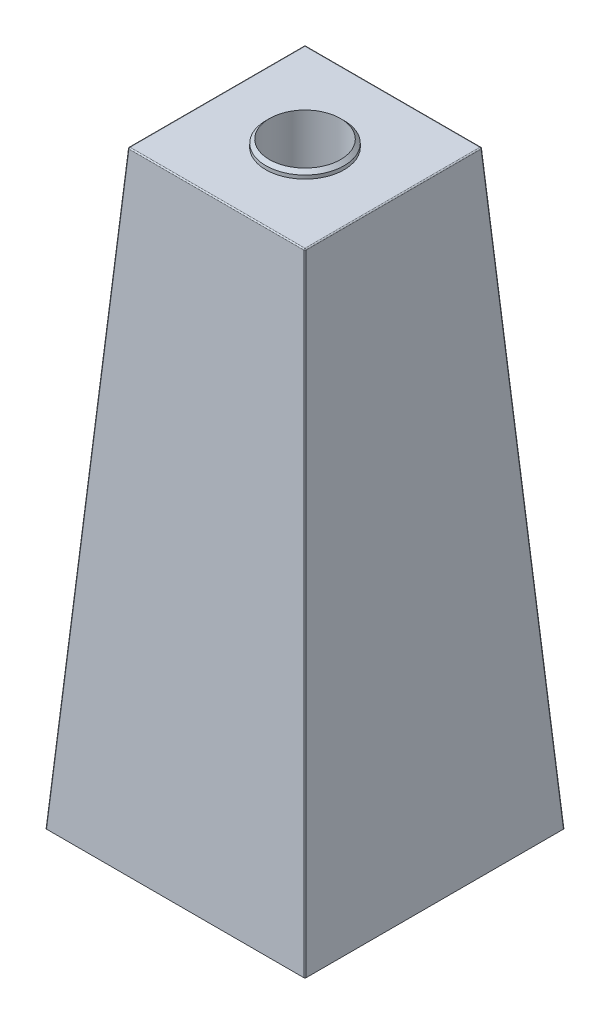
ISO-10303-21;
HEADER;
FILE_DESCRIPTION(('STEP AP214'),'2;1');
FILE_NAME('part.step','',(''),(''),'','','');
FILE_SCHEMA(('AUTOMOTIVE_DESIGN { 1 0 10303 214 1 1 1 1 }'));
ENDSEC;
DATA;
#1=APPLICATION_CONTEXT('core data for automotive mechanical design processes');
#2=APPLICATION_PROTOCOL_DEFINITION('international standard','automotive_design',2000,#1);
#3=PRODUCT_CONTEXT('',#1,'mechanical');
#4=PRODUCT('Part','Part','',(#3));
#5=PRODUCT_RELATED_PRODUCT_CATEGORY('part','',(#4));
#6=PRODUCT_DEFINITION_FORMATION('','',#4);
#7=PRODUCT_DEFINITION_CONTEXT('part definition',#1,'design');
#8=PRODUCT_DEFINITION('design','',#6,#7);
#9=PRODUCT_DEFINITION_SHAPE('','',#8);
#10=(LENGTH_UNIT() NAMED_UNIT(*) SI_UNIT(.MILLI.,.METRE.));
#11=(NAMED_UNIT(*) PLANE_ANGLE_UNIT() SI_UNIT($,.RADIAN.));
#12=(NAMED_UNIT(*) SI_UNIT($,.STERADIAN.) SOLID_ANGLE_UNIT());
#13=UNCERTAINTY_MEASURE_WITH_UNIT(LENGTH_MEASURE(1.E-05),#10,'distance_accuracy_value','');
#14=(GEOMETRIC_REPRESENTATION_CONTEXT(3) GLOBAL_UNCERTAINTY_ASSIGNED_CONTEXT((#13)) GLOBAL_UNIT_ASSIGNED_CONTEXT((#10,
#11,#12)) REPRESENTATION_CONTEXT('',''));
#15=CARTESIAN_POINT('',(0.,0.,0.));
#16=DIRECTION('',(0.,0.,1.));
#17=DIRECTION('',(1.,0.,0.));
#18=AXIS2_PLACEMENT_3D('',#15,#16,#17);
#19=CARTESIAN_POINT('',(0.,-343.762359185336,0.));
#20=DIRECTION('',(0.,1.,0.));
#21=DIRECTION('',(0.,0.,1.));
#22=AXIS2_PLACEMENT_3D('',#19,#20,#21);
#23=CYLINDRICAL_SURFACE('',#22,33.15);
#24=CARTESIAN_POINT('',(0.,3.,0.));
#25=DIRECTION('',(0.,1.,0.));
#26=DIRECTION('',(0.,0.,1.));
#27=AXIS2_PLACEMENT_3D('',#24,#25,#26);
#28=CIRCLE('',#27,33.15);
#29=CARTESIAN_POINT('',(0.,3.,33.15));
#30=VERTEX_POINT('',#29);
#31=EDGE_CURVE('E11',#30,#30,#28,.F.);
#32=ORIENTED_EDGE('',*,*,#31,.T.);
#33=EDGE_LOOP('',(#32));
#34=FACE_BOUND('',#33,.T.);
#35=CARTESIAN_POINT('',(0.,-250.,0.));
#36=DIRECTION('',(0.,1.,0.));
#37=DIRECTION('',(0.,0.,1.));
#38=AXIS2_PLACEMENT_3D('',#35,#36,#37);
#39=CIRCLE('',#38,33.15);
#40=CARTESIAN_POINT('',(0.,-250.,33.15));
#41=VERTEX_POINT('',#40);
#42=EDGE_CURVE('E40',#41,#41,#39,.F.);
#43=ORIENTED_EDGE('',*,*,#42,.F.);
#44=EDGE_LOOP('',(#43));
#45=FACE_BOUND('',#44,.T.);
#46=ADVANCED_FACE('F34',(#34,#45),#23,.T.);
#47=CARTESIAN_POINT('',(0.,-343.762359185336,0.));
#48=DIRECTION('',(0.,1.,0.));
#49=DIRECTION('',(0.,0.,1.));
#50=AXIS2_PLACEMENT_3D('',#47,#48,#49);
#51=CYLINDRICAL_SURFACE('',#50,30.15);
#52=CARTESIAN_POINT('',(0.,-250.,0.));
#53=DIRECTION('',(0.,1.,0.));
#54=DIRECTION('',(0.,0.,1.));
#55=AXIS2_PLACEMENT_3D('',#52,#53,#54);
#56=CIRCLE('',#55,30.15);
#57=CARTESIAN_POINT('',(0.,-250.,30.15));
#58=VERTEX_POINT('',#57);
#59=EDGE_CURVE('E44',#58,#58,#56,.F.);
#60=ORIENTED_EDGE('',*,*,#59,.T.);
#61=EDGE_LOOP('',(#60));
#62=FACE_BOUND('',#61,.T.);
#63=CARTESIAN_POINT('',(0.,6.,0.));
#64=DIRECTION('',(0.,1.,0.));
#65=DIRECTION('',(0.,0.,1.));
#66=AXIS2_PLACEMENT_3D('',#63,#64,#65);
#67=CIRCLE('',#66,30.15);
#68=CARTESIAN_POINT('',(0.,6.,30.15));
#69=VERTEX_POINT('',#68);
#70=EDGE_CURVE('E49',#69,#69,#67,.T.);
#71=ORIENTED_EDGE('',*,*,#70,.T.);
#72=EDGE_LOOP('',(#71));
#73=FACE_BOUND('',#72,.T.);
#74=ADVANCED_FACE('F54',(#62,#73),#51,.F.);
#75=CARTESIAN_POINT('',(0.,-250.,0.));
#76=DIRECTION('',(0.,1.,0.));
#77=DIRECTION('',(0.,0.,1.));
#78=AXIS2_PLACEMENT_3D('',#75,#76,#77);
#79=PLANE('',#78);
#80=ORIENTED_EDGE('',*,*,#42,.T.);
#81=EDGE_LOOP('',(#80));
#82=FACE_BOUND('',#81,.T.);
#83=ORIENTED_EDGE('',*,*,#59,.F.);
#84=EDGE_LOOP('',(#83));
#85=FACE_BOUND('',#84,.T.);
#86=ADVANCED_FACE('F58',(#82,#85),#79,.F.);
#87=CARTESIAN_POINT('',(0.,6.00000000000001,0.));
#88=DIRECTION('',(0.,-1.,0.));
#89=DIRECTION('',(0.,0.,-1.));
#90=AXIS2_PLACEMENT_3D('',#87,#88,#89);
#91=CONICAL_SURFACE('',#90,30.15,0.785398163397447);
#92=ORIENTED_EDGE('',*,*,#31,.F.);
#93=EDGE_LOOP('',(#92));
#94=FACE_BOUND('',#93,.T.);
#95=ORIENTED_EDGE('',*,*,#70,.F.);
#96=EDGE_LOOP('',(#95));
#97=FACE_BOUND('',#96,.T.);
#98=ADVANCED_FACE('F56',(#94,#97),#91,.T.);
#99=CLOSED_SHELL('',(#46,#74,#86,#98));
#100=MANIFOLD_SOLID_BREP('B2',#99);
#101=CARTESIAN_POINT('',(75.,0.,75.));
#102=DIRECTION('',(0.997564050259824,0.0697564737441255,0.));
#103=DIRECTION('',(-0.0697564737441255,0.997564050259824,0.));
#104=AXIS2_PLACEMENT_3D('',#101,#102,#103);
#105=PLANE('',#104);
#106=DIRECTION('',(0.,0.,1.));
#107=VECTOR('',#106,1.);
#108=CARTESIAN_POINT('',(75.0650489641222,-0.930243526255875,75.));
#109=LINE('',#108,#107);
#110=CARTESIAN_POINT('',(75.0650489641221,-0.930243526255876,-74.0674849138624));
#111=VERTEX_POINT('',#110);
#112=CARTESIAN_POINT('',(75.0650489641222,-0.930243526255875,74.0674849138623));
#113=VERTEX_POINT('',#112);
#114=EDGE_CURVE('E201',#111,#113,#109,.T.);
#115=ORIENTED_EDGE('',*,*,#114,.T.);
#116=DIRECTION('',(0.0695873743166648,-0.995145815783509,0.0695873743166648));
#117=VECTOR('',#116,1.);
#118=CARTESIAN_POINT('',(75.0048306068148,-0.069080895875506,74.0072665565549));
#119=LINE('',#118,#117);
#120=CARTESIAN_POINT('',(109.963405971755,-500.,108.965841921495));
#121=VERTEX_POINT('',#120);
#122=EDGE_CURVE('E203',#113,#121,#119,.T.);
#123=ORIENTED_EDGE('',*,*,#122,.T.);
#124=DIRECTION('',(0.,0.,-1.));
#125=VECTOR('',#124,1.);
#126=CARTESIAN_POINT('',(109.963405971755,-500.,-75.));
#127=LINE('',#126,#125);
#128=CARTESIAN_POINT('',(109.963405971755,-500.,-108.965841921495));
#129=VERTEX_POINT('',#128);
#130=EDGE_CURVE('E169',#129,#121,#127,.F.);
#131=ORIENTED_EDGE('',*,*,#130,.F.);
#132=DIRECTION('',(0.0695873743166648,-0.995145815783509,-0.0695873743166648));
#133=VECTOR('',#132,1.);
#134=CARTESIAN_POINT('',(74.2784702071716,10.318356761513,-73.2809061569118));
#135=LINE('',#134,#133);
#136=EDGE_CURVE('E199',#129,#111,#135,.F.);
#137=ORIENTED_EDGE('',*,*,#136,.T.);
#138=EDGE_LOOP('',(#115,#123,#131,#137));
#139=FACE_BOUND('',#138,.T.);
#140=ADVANCED_FACE('F88',(#139),#105,.T.);
#141=CARTESIAN_POINT('',(75.,0.,75.));
#142=DIRECTION('',(0.,0.0697564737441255,0.997564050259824));
#143=DIRECTION('',(0.,-0.997564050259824,0.0697564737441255));
#144=AXIS2_PLACEMENT_3D('',#141,#142,#143);
#145=PLANE('',#144);
#146=DIRECTION('',(1.,0.,0.));
#147=VECTOR('',#146,1.);
#148=CARTESIAN_POINT('',(75.0000000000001,-500.,109.963405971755));
#149=LINE('',#148,#147);
#150=CARTESIAN_POINT('',(108.965841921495,-500.,109.963405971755));
#151=VERTEX_POINT('',#150);
#152=CARTESIAN_POINT('',(-108.965841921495,-500.,109.963405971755));
#153=VERTEX_POINT('',#152);
#154=EDGE_CURVE('E166',#151,#153,#149,.F.);
#155=ORIENTED_EDGE('',*,*,#154,.F.);
#156=DIRECTION('',(0.0695873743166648,-0.995145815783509,0.0695873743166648));
#157=VECTOR('',#156,1.);
#158=CARTESIAN_POINT('',(74.0072665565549,-0.0690808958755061,75.0048306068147));
#159=LINE('',#158,#157);
#160=CARTESIAN_POINT('',(74.0674849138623,-0.930243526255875,75.0650489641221));
#161=VERTEX_POINT('',#160);
#162=EDGE_CURVE('E175',#151,#161,#159,.F.);
#163=ORIENTED_EDGE('',*,*,#162,.T.);
#164=DIRECTION('',(-1.,0.,0.));
#165=VECTOR('',#164,1.);
#166=CARTESIAN_POINT('',(-75.,-0.930243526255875,75.0650489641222));
#167=LINE('',#166,#165);
#168=CARTESIAN_POINT('',(-74.0674849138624,-0.930243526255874,75.0650489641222));
#169=VERTEX_POINT('',#168);
#170=EDGE_CURVE('E186',#161,#169,#167,.T.);
#171=ORIENTED_EDGE('',*,*,#170,.T.);
#172=DIRECTION('',(-0.0695873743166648,-0.995145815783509,0.0695873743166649));
#173=VECTOR('',#172,1.);
#174=CARTESIAN_POINT('',(-73.2809061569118,10.318356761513,74.2784702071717));
#175=LINE('',#174,#173);
#176=EDGE_CURVE('E178',#169,#153,#175,.T.);
#177=ORIENTED_EDGE('',*,*,#176,.T.);
#178=EDGE_LOOP('',(#155,#163,#171,#177));
#179=FACE_BOUND('',#178,.T.);
#180=ADVANCED_FACE('F90',(#179),#145,.T.);
#181=CARTESIAN_POINT('',(-75.,0.,75.0000000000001));
#182=DIRECTION('',(-0.997564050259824,0.0697564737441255,0.));
#183=DIRECTION('',(-0.0697564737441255,-0.997564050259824,0.));
#184=AXIS2_PLACEMENT_3D('',#181,#182,#183);
#185=PLANE('',#184);
#186=DIRECTION('',(0.,0.,-1.));
#187=VECTOR('',#186,1.);
#188=CARTESIAN_POINT('',(-75.0650489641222,-0.930243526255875,-75.));
#189=LINE('',#188,#187);
#190=CARTESIAN_POINT('',(-75.0650489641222,-0.930243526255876,74.0674849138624));
#191=VERTEX_POINT('',#190);
#192=CARTESIAN_POINT('',(-75.0650489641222,-0.930243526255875,-74.0674849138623));
#193=VERTEX_POINT('',#192);
#194=EDGE_CURVE('E103',#191,#193,#189,.T.);
#195=ORIENTED_EDGE('',*,*,#194,.T.);
#196=DIRECTION('',(-0.0695873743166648,-0.995145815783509,-0.0695873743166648));
#197=VECTOR('',#196,1.);
#198=CARTESIAN_POINT('',(-74.2784702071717,10.318356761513,-73.2809061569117));
#199=LINE('',#198,#197);
#200=CARTESIAN_POINT('',(-109.963405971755,-500.,-108.965841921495));
#201=VERTEX_POINT('',#200);
#202=EDGE_CURVE('E213',#193,#201,#199,.T.);
#203=ORIENTED_EDGE('',*,*,#202,.T.);
#204=DIRECTION('',(0.,0.,1.));
#205=VECTOR('',#204,1.);
#206=CARTESIAN_POINT('',(-109.963405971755,-500.,-75.));
#207=LINE('',#206,#205);
#208=CARTESIAN_POINT('',(-109.963405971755,-500.,108.965841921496));
#209=VERTEX_POINT('',#208);
#210=EDGE_CURVE('E179',#209,#201,#207,.F.);
#211=ORIENTED_EDGE('',*,*,#210,.F.);
#212=DIRECTION('',(-0.0695873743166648,-0.995145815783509,0.0695873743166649));
#213=VECTOR('',#212,1.);
#214=CARTESIAN_POINT('',(-75.0048306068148,-0.0690808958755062,74.007266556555));
#215=LINE('',#214,#213);
#216=EDGE_CURVE('E108',#209,#191,#215,.F.);
#217=ORIENTED_EDGE('',*,*,#216,.T.);
#218=EDGE_LOOP('',(#195,#203,#211,#217));
#219=FACE_BOUND('',#218,.T.);
#220=ADVANCED_FACE('F325',(#219),#185,.T.);
#221=CARTESIAN_POINT('',(75.,0.,-75.));
#222=DIRECTION('',(0.,0.0697564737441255,-0.997564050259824));
#223=DIRECTION('',(0.,0.997564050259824,0.0697564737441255));
#224=AXIS2_PLACEMENT_3D('',#221,#222,#223);
#225=PLANE('',#224);
#226=DIRECTION('',(1.,0.,0.));
#227=VECTOR('',#226,1.);
#228=CARTESIAN_POINT('',(75.,-0.930243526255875,-75.0650489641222));
#229=LINE('',#228,#227);
#230=CARTESIAN_POINT('',(-74.0674849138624,-0.930243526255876,-75.0650489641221));
#231=VERTEX_POINT('',#230);
#232=CARTESIAN_POINT('',(74.0674849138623,-0.930243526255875,-75.0650489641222));
#233=VERTEX_POINT('',#232);
#234=EDGE_CURVE('E207',#231,#233,#229,.T.);
#235=ORIENTED_EDGE('',*,*,#234,.T.);
#236=DIRECTION('',(0.0695873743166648,-0.995145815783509,-0.0695873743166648));
#237=VECTOR('',#236,1.);
#238=CARTESIAN_POINT('',(74.0072665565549,-0.0690808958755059,-75.0048306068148));
#239=LINE('',#238,#237);
#240=CARTESIAN_POINT('',(108.965841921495,-500.,-109.963405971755));
#241=VERTEX_POINT('',#240);
#242=EDGE_CURVE('E209',#233,#241,#239,.T.);
#243=ORIENTED_EDGE('',*,*,#242,.T.);
#244=DIRECTION('',(-1.,0.,0.));
#245=VECTOR('',#244,1.);
#246=CARTESIAN_POINT('',(75.,-500.,-109.963405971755));
#247=LINE('',#246,#245);
#248=CARTESIAN_POINT('',(-108.965841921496,-500.,-109.963405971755));
#249=VERTEX_POINT('',#248);
#250=EDGE_CURVE('E221',#249,#241,#247,.F.);
#251=ORIENTED_EDGE('',*,*,#250,.F.);
#252=DIRECTION('',(-0.0695873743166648,-0.995145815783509,-0.0695873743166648));
#253=VECTOR('',#252,1.);
#254=CARTESIAN_POINT('',(-73.2809061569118,10.318356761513,-74.2784702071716));
#255=LINE('',#254,#253);
#256=EDGE_CURVE('E205',#249,#231,#255,.F.);
#257=ORIENTED_EDGE('',*,*,#256,.T.);
#258=EDGE_LOOP('',(#235,#243,#251,#257));
#259=FACE_BOUND('',#258,.T.);
#260=ADVANCED_FACE('F285',(#259),#225,.T.);
#261=CARTESIAN_POINT('',(75.,-500.,-75.));
#262=DIRECTION('',(0.,1.,0.));
#263=DIRECTION('',(0.,0.,1.));
#264=AXIS2_PLACEMENT_3D('',#261,#262,#263);
#265=PLANE('',#264);
#266=ORIENTED_EDGE('',*,*,#130,.T.);
#267=CARTESIAN_POINT('',(108.960964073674,-500.,108.960964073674));
#268=DIRECTION('',(0.,1.,0.));
#269=DIRECTION('',(-0.707106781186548,0.,-0.707106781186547));
#270=AXIS2_PLACEMENT_3D('',#267,#268,#269);
#271=ELLIPSE('',#270,1.00487786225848,1.);
#272=EDGE_CURVE('E32',#121,#151,#271,.F.);
#273=ORIENTED_EDGE('',*,*,#272,.T.);
#274=ORIENTED_EDGE('',*,*,#154,.T.);
#275=CARTESIAN_POINT('',(-108.960964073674,-500.,108.960964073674));
#276=DIRECTION('',(0.,1.,0.));
#277=DIRECTION('',(0.707106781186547,0.,-0.707106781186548));
#278=AXIS2_PLACEMENT_3D('',#275,#276,#277);
#279=ELLIPSE('',#278,1.00487786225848,1.);
#280=EDGE_CURVE('E215',#153,#209,#279,.F.);
#281=ORIENTED_EDGE('',*,*,#280,.T.);
#282=ORIENTED_EDGE('',*,*,#210,.T.);
#283=CARTESIAN_POINT('',(-108.960964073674,-500.,-108.960964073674));
#284=DIRECTION('',(0.,1.,0.));
#285=DIRECTION('',(0.707106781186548,0.,0.707106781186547));
#286=AXIS2_PLACEMENT_3D('',#283,#284,#285);
#287=ELLIPSE('',#286,1.00487786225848,1.);
#288=EDGE_CURVE('E217',#201,#249,#287,.F.);
#289=ORIENTED_EDGE('',*,*,#288,.T.);
#290=ORIENTED_EDGE('',*,*,#250,.T.);
#291=CARTESIAN_POINT('',(108.960964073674,-500.,-108.960964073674));
#292=DIRECTION('',(0.,1.,0.));
#293=DIRECTION('',(-0.707106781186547,0.,0.707106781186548));
#294=AXIS2_PLACEMENT_3D('',#291,#292,#293);
#295=ELLIPSE('',#294,1.00487786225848,1.);
#296=EDGE_CURVE('E96',#241,#129,#295,.F.);
#297=ORIENTED_EDGE('',*,*,#296,.T.);
#298=EDGE_LOOP('',(#266,#273,#274,#281,#282,#289,#290,#297));
#299=FACE_BOUND('',#298,.T.);
#300=ADVANCED_FACE('F165',(#299),#265,.F.);
#301=CARTESIAN_POINT('',(75.,0.,-75.));
#302=DIRECTION('',(0.,1.,0.));
#303=DIRECTION('',(0.,0.,1.));
#304=AXIS2_PLACEMENT_3D('',#301,#302,#303);
#305=PLANE('',#304);
#306=DIRECTION('',(0.,0.,1.));
#307=VECTOR('',#306,1.);
#308=CARTESIAN_POINT('',(-74.0674849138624,0.,75.0000000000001));
#309=LINE('',#308,#307);
#310=CARTESIAN_POINT('',(-74.0674849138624,0.,-74.0674849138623));
#311=VERTEX_POINT('',#310);
#312=CARTESIAN_POINT('',(-74.0674849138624,0.,74.0674849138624));
#313=VERTEX_POINT('',#312);
#314=EDGE_CURVE('E185',#311,#313,#309,.T.);
#315=ORIENTED_EDGE('',*,*,#314,.T.);
#316=DIRECTION('',(1.,0.,0.));
#317=VECTOR('',#316,1.);
#318=CARTESIAN_POINT('',(75.,0.,74.0674849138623));
#319=LINE('',#318,#317);
#320=CARTESIAN_POINT('',(74.0674849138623,0.,74.0674849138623));
#321=VERTEX_POINT('',#320);
#322=EDGE_CURVE('E196',#313,#321,#319,.T.);
#323=ORIENTED_EDGE('',*,*,#322,.T.);
#324=DIRECTION('',(0.,0.,-1.));
#325=VECTOR('',#324,1.);
#326=CARTESIAN_POINT('',(74.0674849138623,0.,-75.));
#327=LINE('',#326,#325);
#328=CARTESIAN_POINT('',(74.0674849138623,0.,-74.0674849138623));
#329=VERTEX_POINT('',#328);
#330=EDGE_CURVE('E194',#321,#329,#327,.T.);
#331=ORIENTED_EDGE('',*,*,#330,.T.);
#332=DIRECTION('',(-1.,0.,0.));
#333=VECTOR('',#332,1.);
#334=CARTESIAN_POINT('',(-75.0000000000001,0.,-74.0674849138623));
#335=LINE('',#334,#333);
#336=EDGE_CURVE('E188',#329,#311,#335,.T.);
#337=ORIENTED_EDGE('',*,*,#336,.T.);
#338=EDGE_LOOP('',(#315,#323,#331,#337));
#339=FACE_BOUND('',#338,.T.);
#340=CARTESIAN_POINT('',(0.,0.,0.));
#341=DIRECTION('',(0.,1.,0.));
#342=DIRECTION('',(0.,0.,1.));
#343=AXIS2_PLACEMENT_3D('',#340,#341,#342);
#344=CIRCLE('',#343,33.15);
#345=CARTESIAN_POINT('',(0.,0.,33.15));
#346=VERTEX_POINT('',#345);
#347=EDGE_CURVE('E271',#346,#346,#344,.T.);
#348=ORIENTED_EDGE('',*,*,#347,.F.);
#349=EDGE_LOOP('',(#348));
#350=FACE_BOUND('',#349,.T.);
#351=ADVANCED_FACE('F292',(#339,#350),#305,.T.);
#352=CARTESIAN_POINT('',(0.,-250.,0.));
#353=DIRECTION('',(0.,1.,0.));
#354=DIRECTION('',(0.,0.,1.));
#355=AXIS2_PLACEMENT_3D('',#352,#353,#354);
#356=CYLINDRICAL_SURFACE('',#355,33.15);
#357=CARTESIAN_POINT('',(0.,-250.,0.));
#358=DIRECTION('',(0.,1.,0.));
#359=DIRECTION('',(0.,0.,1.));
#360=AXIS2_PLACEMENT_3D('',#357,#358,#359);
#361=CIRCLE('',#360,33.15);
#362=CARTESIAN_POINT('',(0.,-250.,33.15));
#363=VERTEX_POINT('',#362);
#364=EDGE_CURVE('E227',#363,#363,#361,.T.);
#365=ORIENTED_EDGE('',*,*,#364,.F.);
#366=EDGE_LOOP('',(#365));
#367=FACE_BOUND('',#366,.T.);
#368=ORIENTED_EDGE('',*,*,#347,.T.);
#369=EDGE_LOOP('',(#368));
#370=FACE_BOUND('',#369,.T.);
#371=ADVANCED_FACE('F350',(#367,#370),#356,.F.);
#372=CARTESIAN_POINT('',(0.,-250.,0.));
#373=DIRECTION('',(0.,1.,0.));
#374=DIRECTION('',(0.,0.,1.));
#375=AXIS2_PLACEMENT_3D('',#372,#373,#374);
#376=PLANE('',#375);
#377=ORIENTED_EDGE('',*,*,#364,.T.);
#378=EDGE_LOOP('',(#377));
#379=FACE_BOUND('',#378,.T.);
#380=ADVANCED_FACE('F357',(#379),#376,.T.);
#381=CARTESIAN_POINT('',(73.2809061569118,10.2486002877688,-73.2809061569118));
#382=DIRECTION('',(-0.0695873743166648,0.995145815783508,0.0695873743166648));
#383=DIRECTION('',(0.,-0.0697564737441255,0.997564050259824));
#384=AXIS2_PLACEMENT_3D('',#381,#382,#383);
#385=CYLINDRICAL_SURFACE('',#384,1.);
#386=ORIENTED_EDGE('',*,*,#296,.F.);
#387=ORIENTED_EDGE('',*,*,#242,.F.);
#388=CARTESIAN_POINT('',(74.0674849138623,-1.,-74.0674849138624));
#389=DIRECTION('',(-0.0695873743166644,0.995145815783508,0.0695873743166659));
#390=DIRECTION('',(0.,-0.0697564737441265,0.997564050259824));
#391=AXIS2_PLACEMENT_3D('',#388,#389,#390);
#392=CIRCLE('',#391,1.);
#393=EDGE_CURVE('E231',#111,#233,#392,.T.);
#394=ORIENTED_EDGE('',*,*,#393,.F.);
#395=ORIENTED_EDGE('',*,*,#136,.F.);
#396=EDGE_LOOP('',(#386,#387,#394,#395));
#397=FACE_BOUND('',#396,.T.);
#398=ADVANCED_FACE('F229',(#397),#385,.T.);
#399=CARTESIAN_POINT('',(-73.2809061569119,10.2486002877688,-73.2809061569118));
#400=DIRECTION('',(0.0695873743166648,0.995145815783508,0.0695873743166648));
#401=DIRECTION('',(-0.997564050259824,0.0697564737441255,0.));
#402=AXIS2_PLACEMENT_3D('',#399,#400,#401);
#403=CYLINDRICAL_SURFACE('',#402,1.);
#404=ORIENTED_EDGE('',*,*,#288,.F.);
#405=ORIENTED_EDGE('',*,*,#202,.F.);
#406=CARTESIAN_POINT('',(-74.0674849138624,-1.,-74.0674849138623));
#407=DIRECTION('',(0.0695873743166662,0.995145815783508,0.0695873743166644));
#408=DIRECTION('',(-0.997564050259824,0.0697564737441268,0.));
#409=AXIS2_PLACEMENT_3D('',#406,#407,#408);
#410=CIRCLE('',#409,1.);
#411=EDGE_CURVE('E237',#231,#193,#410,.T.);
#412=ORIENTED_EDGE('',*,*,#411,.F.);
#413=ORIENTED_EDGE('',*,*,#256,.F.);
#414=EDGE_LOOP('',(#404,#405,#412,#413));
#415=FACE_BOUND('',#414,.T.);
#416=ADVANCED_FACE('F281',(#415),#403,.T.);
#417=CARTESIAN_POINT('',(75.,-1.,-74.0674849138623));
#418=DIRECTION('',(1.,0.,0.));
#419=DIRECTION('',(0.,0.,-1.));
#420=AXIS2_PLACEMENT_3D('',#417,#418,#419);
#421=CYLINDRICAL_SURFACE('',#420,1.);
#422=CARTESIAN_POINT('',(74.0674849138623,-1.,-74.0674849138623));
#423=DIRECTION('',(1.,0.,0.));
#424=DIRECTION('',(0.,0.,-1.));
#425=AXIS2_PLACEMENT_3D('',#422,#423,#424);
#426=CIRCLE('',#425,1.);
#427=EDGE_CURVE('E236',#233,#329,#426,.T.);
#428=ORIENTED_EDGE('',*,*,#427,.F.);
#429=ORIENTED_EDGE('',*,*,#234,.F.);
#430=CARTESIAN_POINT('',(-74.0674849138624,-1.,-74.0674849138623));
#431=DIRECTION('',(-1.,0.,0.));
#432=DIRECTION('',(0.,0.,1.));
#433=AXIS2_PLACEMENT_3D('',#430,#431,#432);
#434=CIRCLE('',#433,1.);
#435=EDGE_CURVE('E245',#311,#231,#434,.T.);
#436=ORIENTED_EDGE('',*,*,#435,.F.);
#437=ORIENTED_EDGE('',*,*,#336,.F.);
#438=EDGE_LOOP('',(#428,#429,#436,#437));
#439=FACE_BOUND('',#438,.T.);
#440=ADVANCED_FACE('F288',(#439),#421,.T.);
#441=CARTESIAN_POINT('',(74.0674849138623,-1.,-74.0674849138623));
#442=DIRECTION('',(0.,0.,1.));
#443=DIRECTION('',(1.,0.,0.));
#444=AXIS2_PLACEMENT_3D('',#441,#442,#443);
#445=SPHERICAL_SURFACE('',#444,1.);
#446=ORIENTED_EDGE('',*,*,#393,.T.);
#447=ORIENTED_EDGE('',*,*,#427,.T.);
#448=CARTESIAN_POINT('',(74.0674849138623,-1.,-74.0674849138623));
#449=DIRECTION('',(0.,0.,-1.));
#450=DIRECTION('',(-1.,0.,0.));
#451=AXIS2_PLACEMENT_3D('',#448,#449,#450);
#452=CIRCLE('',#451,1.);
#453=EDGE_CURVE('E240',#111,#329,#452,.F.);
#454=ORIENTED_EDGE('',*,*,#453,.F.);
#455=EDGE_LOOP('',(#446,#447,#454));
#456=FACE_BOUND('',#455,.T.);
#457=ADVANCED_FACE('F242',(#456),#445,.T.);
#458=CARTESIAN_POINT('',(-74.0674849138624,-1.,-74.0674849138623));
#459=DIRECTION('',(0.,0.,1.));
#460=DIRECTION('',(1.,0.,0.));
#461=AXIS2_PLACEMENT_3D('',#458,#459,#460);
#462=SPHERICAL_SURFACE('',#461,1.);
#463=ORIENTED_EDGE('',*,*,#435,.T.);
#464=ORIENTED_EDGE('',*,*,#411,.T.);
#465=CARTESIAN_POINT('',(-74.0674849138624,-1.,-74.0674849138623));
#466=DIRECTION('',(0.,0.,-1.));
#467=DIRECTION('',(-1.,0.,0.));
#468=AXIS2_PLACEMENT_3D('',#465,#466,#467);
#469=CIRCLE('',#468,1.);
#470=EDGE_CURVE('E246',#311,#193,#469,.F.);
#471=ORIENTED_EDGE('',*,*,#470,.F.);
#472=EDGE_LOOP('',(#463,#464,#471));
#473=FACE_BOUND('',#472,.T.);
#474=ADVANCED_FACE('F377',(#473),#462,.T.);
#475=CARTESIAN_POINT('',(74.0674849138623,-1.,75.));
#476=DIRECTION('',(0.,0.,1.));
#477=DIRECTION('',(1.,0.,0.));
#478=AXIS2_PLACEMENT_3D('',#475,#476,#477);
#479=CYLINDRICAL_SURFACE('',#478,1.);
#480=ORIENTED_EDGE('',*,*,#453,.T.);
#481=ORIENTED_EDGE('',*,*,#330,.F.);
#482=CARTESIAN_POINT('',(74.0674849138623,-1.,74.0674849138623));
#483=DIRECTION('',(0.,0.,1.));
#484=DIRECTION('',(1.,0.,0.));
#485=AXIS2_PLACEMENT_3D('',#482,#483,#484);
#486=CIRCLE('',#485,1.);
#487=EDGE_CURVE('E251',#113,#321,#486,.T.);
#488=ORIENTED_EDGE('',*,*,#487,.F.);
#489=ORIENTED_EDGE('',*,*,#114,.F.);
#490=EDGE_LOOP('',(#480,#481,#488,#489));
#491=FACE_BOUND('',#490,.T.);
#492=ADVANCED_FACE('F249',(#491),#479,.T.);
#493=CARTESIAN_POINT('',(74.0072665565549,-0.138837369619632,74.0072665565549));
#494=DIRECTION('',(-0.0695873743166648,0.995145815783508,-0.0695873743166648));
#495=DIRECTION('',(-0.997564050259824,-0.0697564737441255,0.));
#496=AXIS2_PLACEMENT_3D('',#493,#494,#495);
#497=CYLINDRICAL_SURFACE('',#496,1.);
#498=ORIENTED_EDGE('',*,*,#272,.F.);
#499=ORIENTED_EDGE('',*,*,#122,.F.);
#500=CARTESIAN_POINT('',(74.0674849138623,-1.,74.0674849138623));
#501=DIRECTION('',(-0.0695873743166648,0.995145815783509,-0.0695873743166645));
#502=DIRECTION('',(-0.997564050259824,-0.0697564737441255,0.));
#503=AXIS2_PLACEMENT_3D('',#500,#501,#502);
#504=CIRCLE('',#503,1.);
#505=EDGE_CURVE('E183',#161,#113,#504,.T.);
#506=ORIENTED_EDGE('',*,*,#505,.F.);
#507=ORIENTED_EDGE('',*,*,#162,.F.);
#508=EDGE_LOOP('',(#498,#499,#506,#507));
#509=FACE_BOUND('',#508,.T.);
#510=ADVANCED_FACE('F181',(#509),#497,.T.);
#511=CARTESIAN_POINT('',(-74.007266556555,-0.138837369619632,74.007266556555));
#512=DIRECTION('',(0.0695873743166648,0.995145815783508,-0.0695873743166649));
#513=DIRECTION('',(0.,0.0697564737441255,0.997564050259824));
#514=AXIS2_PLACEMENT_3D('',#511,#512,#513);
#515=CYLINDRICAL_SURFACE('',#514,1.);
#516=ORIENTED_EDGE('',*,*,#280,.F.);
#517=ORIENTED_EDGE('',*,*,#176,.F.);
#518=CARTESIAN_POINT('',(-74.0674849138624,-1.,74.0674849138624));
#519=DIRECTION('',(0.0695873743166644,0.995145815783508,-0.0695873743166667));
#520=DIRECTION('',(0.,0.0697564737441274,0.997564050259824));
#521=AXIS2_PLACEMENT_3D('',#518,#519,#520);
#522=CIRCLE('',#521,1.);
#523=EDGE_CURVE('E257',#191,#169,#522,.T.);
#524=ORIENTED_EDGE('',*,*,#523,.F.);
#525=ORIENTED_EDGE('',*,*,#216,.F.);
#526=EDGE_LOOP('',(#516,#517,#524,#525));
#527=FACE_BOUND('',#526,.T.);
#528=ADVANCED_FACE('F308',(#527),#515,.T.);
#529=CARTESIAN_POINT('',(-74.0674849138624,-1.,75.0000000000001));
#530=DIRECTION('',(0.,0.,-1.));
#531=DIRECTION('',(-1.,0.,0.));
#532=AXIS2_PLACEMENT_3D('',#529,#530,#531);
#533=CYLINDRICAL_SURFACE('',#532,1.);
#534=ORIENTED_EDGE('',*,*,#470,.T.);
#535=ORIENTED_EDGE('',*,*,#194,.F.);
#536=CARTESIAN_POINT('',(-74.0674849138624,-1.,74.0674849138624));
#537=DIRECTION('',(0.,0.,1.));
#538=DIRECTION('',(1.,0.,0.));
#539=AXIS2_PLACEMENT_3D('',#536,#537,#538);
#540=CIRCLE('',#539,1.);
#541=EDGE_CURVE('E260',#313,#191,#540,.T.);
#542=ORIENTED_EDGE('',*,*,#541,.F.);
#543=ORIENTED_EDGE('',*,*,#314,.F.);
#544=EDGE_LOOP('',(#534,#535,#542,#543));
#545=FACE_BOUND('',#544,.T.);
#546=ADVANCED_FACE('F310',(#545),#533,.T.);
#547=CARTESIAN_POINT('',(74.0674849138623,-1.,74.0674849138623));
#548=DIRECTION('',(0.,0.,1.));
#549=DIRECTION('',(1.,0.,0.));
#550=AXIS2_PLACEMENT_3D('',#547,#548,#549);
#551=SPHERICAL_SURFACE('',#550,1.);
#552=ORIENTED_EDGE('',*,*,#505,.T.);
#553=ORIENTED_EDGE('',*,*,#487,.T.);
#554=CARTESIAN_POINT('',(74.0674849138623,-1.,74.0674849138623));
#555=DIRECTION('',(1.,0.,0.));
#556=DIRECTION('',(0.,0.,-1.));
#557=AXIS2_PLACEMENT_3D('',#554,#555,#556);
#558=CIRCLE('',#557,1.);
#559=EDGE_CURVE('E255',#161,#321,#558,.F.);
#560=ORIENTED_EDGE('',*,*,#559,.F.);
#561=EDGE_LOOP('',(#552,#553,#560));
#562=FACE_BOUND('',#561,.T.);
#563=ADVANCED_FACE('F254',(#562),#551,.T.);
#564=CARTESIAN_POINT('',(-74.0674849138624,-1.,74.0674849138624));
#565=DIRECTION('',(0.,0.,1.));
#566=DIRECTION('',(1.,0.,0.));
#567=AXIS2_PLACEMENT_3D('',#564,#565,#566);
#568=SPHERICAL_SURFACE('',#567,1.);
#569=ORIENTED_EDGE('',*,*,#541,.T.);
#570=ORIENTED_EDGE('',*,*,#523,.T.);
#571=CARTESIAN_POINT('',(-74.0674849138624,-1.,74.0674849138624));
#572=DIRECTION('',(-1.,0.,0.));
#573=DIRECTION('',(0.,0.,1.));
#574=AXIS2_PLACEMENT_3D('',#571,#572,#573);
#575=CIRCLE('',#574,1.);
#576=EDGE_CURVE('E300',#313,#169,#575,.F.);
#577=ORIENTED_EDGE('',*,*,#576,.F.);
#578=EDGE_LOOP('',(#569,#570,#577));
#579=FACE_BOUND('',#578,.T.);
#580=ADVANCED_FACE('F303',(#579),#568,.T.);
#581=CARTESIAN_POINT('',(75.,-1.,74.0674849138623));
#582=DIRECTION('',(-1.,0.,0.));
#583=DIRECTION('',(0.,0.,1.));
#584=AXIS2_PLACEMENT_3D('',#581,#582,#583);
#585=CYLINDRICAL_SURFACE('',#584,1.);
#586=ORIENTED_EDGE('',*,*,#559,.T.);
#587=ORIENTED_EDGE('',*,*,#322,.F.);
#588=ORIENTED_EDGE('',*,*,#576,.T.);
#589=ORIENTED_EDGE('',*,*,#170,.F.);
#590=EDGE_LOOP('',(#586,#587,#588,#589));
#591=FACE_BOUND('',#590,.T.);
#592=ADVANCED_FACE('F299',(#591),#585,.T.);
#593=CLOSED_SHELL('',(#140,#180,#220,#260,#300,#351,#371,#380,#398,#416,#440,#457,#474,#492,
#510,#528,#546,#563,#580,#592));
#594=MANIFOLD_SOLID_BREP('B6',#593);
#595=ADVANCED_BREP_SHAPE_REPRESENTATION('',(#18,#100,#594),#14);
#596=SHAPE_DEFINITION_REPRESENTATION(#9,#595);
ENDSEC;
END-ISO-10303-21;
